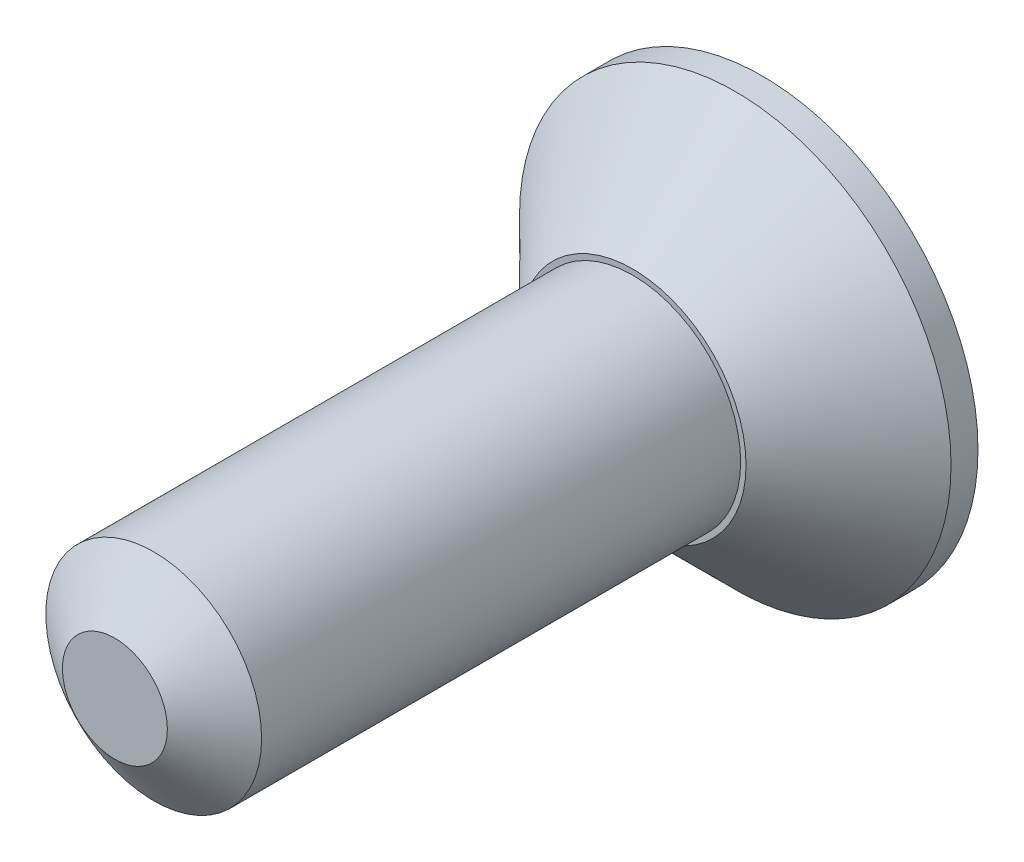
from build123d import *

# Parameters (mm, degrees)
SKETCH1_R          = 1
EXTRUDE1_DEPTH     = 6
SKETCH6_R          = 2
EXTRUDE2_DEPTH     = 1.2
CUT_EXTRUDE1_DEPTH = 0.975
SKETCH8_R          = 0.75055535
CUT_EXTRUDE2_DEPTH = 7.633249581
CUT_EXTRUDE2_TAPER = 45


with BuildPart() as part:
    # Sketch1 → Extrude1 (new body)
    with BuildSketch(Plane.XY):
        Circle(SKETCH1_R)
    extrude(amount=-EXTRUDE1_DEPTH)

    # Sketch4 → Cut-Revolve1 (revolve, cut)
    with BuildSketch(Plane(origin=(0, 0, 0), x_dir=(0, 0, -1), z_dir=(1, 0, 0)), mode=Mode.PRIVATE) as cut_revolve1_sk:
        Polygon((0.35977197, 1), (0, 0.486192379), (0, 1), align=None)
    revolve(cut_revolve1_sk.sketch.rotate(Axis((0, 0, 0), (0, 0, -1)), 90), axis=Axis((0, 0, 0), (0, 0, -1)), mode=Mode.SUBTRACT)

    # Sketch6 → Extrude2 (add)
    with BuildSketch(Plane(origin=(0, 0, -6), x_dir=(-1, 0, 0), z_dir=(0, 0, -1))):
        Circle(SKETCH6_R)
    extrude(amount=-EXTRUDE2_DEPTH)

    # Sketch10 → Cut-Revolve2 (revolve, cut)
    with BuildSketch(Plane(origin=(0, 0, 0), x_dir=(0, 0, -1), z_dir=(1, 0, 0)), mode=Mode.PRIVATE) as cut_revolve2_sk:
        Polygon((5.75, -2), (4.8, -1.05), (4.8, -2), align=None)
    revolve(cut_revolve2_sk.sketch.rotate(Axis((0, 0, 0), (0, 0, -1)), 270), axis=Axis((0, 0, 0), (0, 0, -1)), mode=Mode.SUBTRACT)

    # Sketch7 → Cut-Extrude1 (cut)
    with BuildSketch(Plane.XY.offset(-6)):
        Polygon((0, 0.75055535), (-0.65, 0.375277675), (-0.65, -0.375277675), (0, -0.75055535), (0.65, -0.375277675), (0.65, 0.375277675), align=None)
    extrude(amount=CUT_EXTRUDE1_DEPTH, mode=Mode.SUBTRACT)

    # Sketch8 → Cut-Extrude2 (cut, through all)
    with BuildSketch(Plane.XY.offset(-6)):
        Circle(SKETCH8_R)
    extrude(amount=CUT_EXTRUDE2_DEPTH, taper=CUT_EXTRUDE2_TAPER, mode=Mode.SUBTRACT)


solid = part.part
